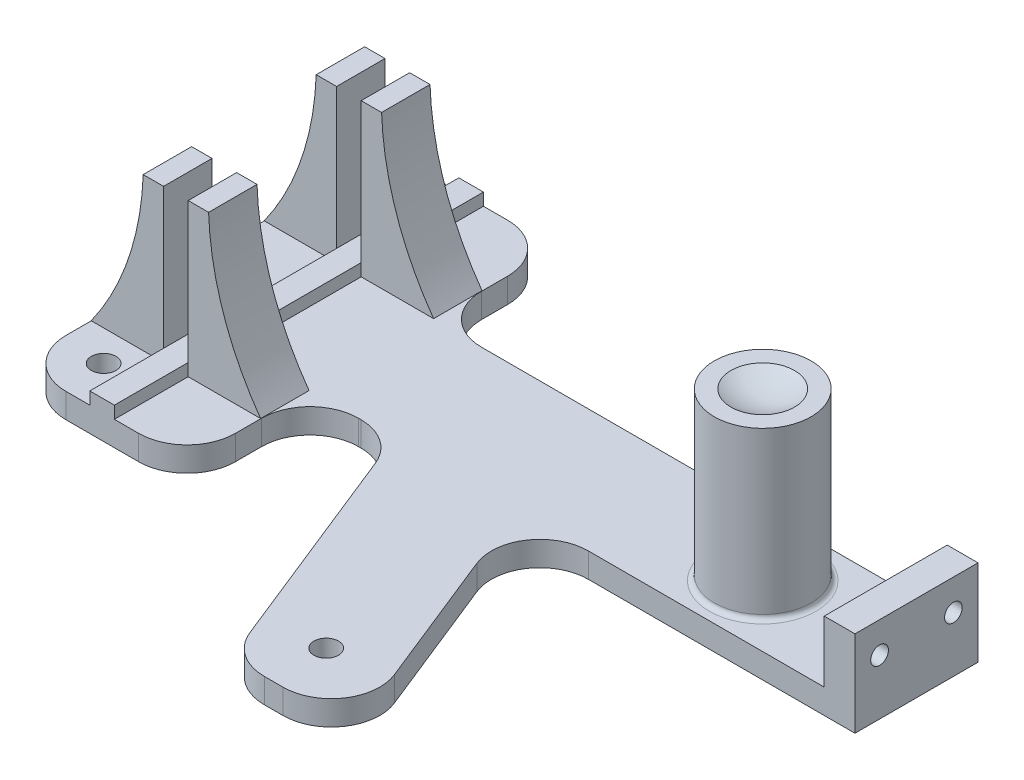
from build123d import *

# Parameters (mm, degrees)
BOSS_EXTRUDE1_DEPTH       = 5.08
BOSS_EXTRUDE2_DEPTH       = 10
SKETCH3_R                 = 10
BOSS_EXTRUDE3_DEPTH       = 34.29
FILLET1_R                 = 1
SKETCH9_W                 = 6.35
SKETCH9_H                 = 25.4
BOSS_EXTRUDE6_DEPTH       = 12.7
F_6_CLEARANCE_HOLE1_D     = 3.6576
F_6_CLEARANCE_HOLE1_DEPTH = 6.35
BOSS_EXTRUDE7_DEPTH       = 5.08
FILLET4_R                 = 10
FILLET5_R                 = 10
CUT_EXTRUDE1_REACH        = 156.38
SKETCH18_R                = 2.54
SKETCH21_W                = 5.08
SKETCH21_H                = 76.2
BOSS_EXTRUDE8_DEPTH       = 2.54


with BuildPart() as part:
    # Sketch1 → Boss-Extrude1 (new body)
    with BuildSketch(Plane(origin=(0, 0, 0), x_dir=(1, 0, 0), z_dir=(0, 1, 0))):
        with BuildLine():
            Line((20.08, 28.1), (20.08, 22.7))
            ThreePointArc((20.08, 22.7), (23.008932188, 15.628932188), (30.08, 12.7))
            Line((30.08, 12.7), (126.24, 12.7))
            Line((126.24, 12.7), (132.59, 12.7))
            Line((132.59, 12.7), (132.59, 0))
            Line((132.59, 0), (132.59, -12.7))
            Line((132.59, -12.7), (126.24, -12.7))
            Line((126.24, -12.7), (30.08, -12.7))
            ThreePointArc((30.08, -12.7), (23.008932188, -15.628932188), (20.08, -22.7))
            Line((20.08, -22.7), (20.08, -28.1))
            ThreePointArc((20.08, -28.1), (17.151067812, -35.171067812), (10.08, -38.1))
            Line((10.08, -38.1), (-4.92, -38.1))
            ThreePointArc((-4.92, -38.1), (-11.991067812, -35.171067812), (-14.92, -28.1))
            Line((-14.92, -28.1), (-14.92, 28.1))
            ThreePointArc((-14.92, 28.1), (-11.991067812, 35.171067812), (-4.92, 38.1))
            Line((-4.92, 38.1), (10.08, 38.1))
            ThreePointArc((10.08, 38.1), (17.151067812, 35.171067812), (20.08, 28.1))
        make_face()
    extrude(amount=-BOSS_EXTRUDE1_DEPTH)

    # Sketch2 → Boss-Extrude2 (add)
    with BuildSketch(Plane.XY.offset(22.86)):
        with BuildLine():
            Line((0, 0), (-14.953299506, 0))
            ThreePointArc((-14.953299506, 0), (-7.255141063, 14.95657571), (-4.209502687, 31.5))
            Line((-4.209502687, 31.5), (0, 31.5))
            Line((0, 31.5), (0, 0))
        make_face()
        with BuildLine():
            Line((5.08, 0), (20.033299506, 0))
            ThreePointArc((20.033299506, 0), (12.335141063, 14.95657571), (9.289502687, 31.5))
            Line((9.289502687, 31.5), (5.08, 31.5))
            Line((5.08, 31.5), (5.08, 0))
        make_face()
    boss_extrude2 = extrude(amount=-BOSS_EXTRUDE2_DEPTH)

    # Mirror1: Boss-Extrude2 across plane
    add(boss_extrude2.mirror(Plane.XY))

    # Sketch3 → Boss-Extrude3 (add)
    with BuildSketch(Plane(origin=(0, 0, 0), x_dir=(1, 0, 0), z_dir=(0, 1, 0))):
        with Locations(Location((100.84, 0, 0), (0, 0, 270))):
            Circle(SKETCH3_R)
    extrude(amount=BOSS_EXTRUDE3_DEPTH)

    # Fillet1
    fillet1_edges = [part.edges().sort_by_distance(p)[0] for p in [
        (100.84, 0, -10),
    ]]
    fillet(fillet1_edges, radius=FILLET1_R)

    # Sketch4 → Cut-Revolve1 (revolve, cut)
    with BuildSketch(Plane.XY):
        with BuildLine():
            Line((100.84, 34.29), (107.399510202, 34.29))
            ThreePointArc((107.399510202, 34.29), (104.216336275, 33.092422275), (100.84, 32.683592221))
            Line((100.84, 32.683592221), (100.84, 34.29))
        make_face()
    revolve(axis=Axis((100.84, 34.29, 0), (0, -1, 0)), mode=Mode.SUBTRACT)

    # Sketch9 → Boss-Extrude6 (add)
    with BuildSketch(Plane(origin=(0, 0, 0), x_dir=(1, 0, 0), z_dir=(0, 1, 0))):
        with Locations((129.415, 0)):
            Rectangle(SKETCH9_W, SKETCH9_H)
    extrude(amount=BOSS_EXTRUDE6_DEPTH)

    # 6 Clearance Hole1
    with Locations(Plane(origin=(132.59, 0, 0), x_dir=(0, 0, -1), z_dir=(1, 0, 0))):
        with Locations((7.62, 6.35), (-7.62, 6.35)):
            Hole(F_6_CLEARANCE_HOLE1_D / 2, depth=F_6_CLEARANCE_HOLE1_DEPTH)

    # Sketch17 → Boss-Extrude7 (add)
    with BuildSketch(Plane(origin=(0, 0, 0), x_dir=(1, 0, 0), z_dir=(0, 1, 0))):
        with BuildLine():
            Line((37.34, -12.7), (57.230452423, -62.301920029))
            ThreePointArc((57.230452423, -62.301920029), (60.909296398, -66.863091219), (66.512010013, -68.58))
            Line((66.512010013, -68.58), (70.36390259, -68.58))
            ThreePointArc((70.36390259, -68.58), (78.646993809, -64.182713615), (79.64546018, -54.858079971))
            Line((79.64546018, -54.858079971), (62.74, -12.7))
            Line((62.74, -12.7), (37.34, -12.7))
        make_face()
    extrude(amount=-BOSS_EXTRUDE7_DEPTH)

    # Fillet4
    fillet4_edges = [part.edges().sort_by_distance(p)[0] for p in [
        (62.74, -2.54, 12.7),
    ]]
    fillet(fillet4_edges, radius=FILLET4_R)

    # Fillet5
    fillet5_edges = [part.edges().sort_by_distance(p)[0] for p in [
        (37.34, -2.54, 12.7),
    ]]
    fillet(fillet5_edges, radius=FILLET5_R)

    # Sketch18 → Cut-Extrude1 (cut, up to next)
    with BuildSketch(Plane.XZ.offset(5.08), mode=Mode.PRIVATE) as cut_extrude1_sk1:
        with Locations(Location((-6.03, 29.21, 0), (0, 0, 270))):
            Circle(SKETCH18_R)
    cut_extrude1_tool1 = extrude(cut_extrude1_sk1.sketch, amount=-CUT_EXTRUDE1_REACH, mode=Mode.PRIVATE) & part.part
    # Sketch18 → Cut-Extrude1 (cut, up to next)
    with BuildSketch(Plane.XZ.offset(5.08), mode=Mode.PRIVATE) as cut_extrude1_sk2:
        with Locations(Location((-6.03, -29.21, 0), (0, 0, 90))):
            Circle(SKETCH18_R)
    cut_extrude1_tool2 = extrude(cut_extrude1_sk2.sketch, amount=-CUT_EXTRUDE1_REACH, mode=Mode.PRIVATE) & part.part
    # Sketch18 → Cut-Extrude1 (cut, up to next)
    with BuildSketch(Plane.XZ.offset(5.08), mode=Mode.PRIVATE) as cut_extrude1_sk3:
        with Locations(Location((67.864523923, 57.15, 0), (0, 0, 270))):
            Circle(SKETCH18_R)
    cut_extrude1_tool3 = extrude(cut_extrude1_sk3.sketch, amount=-CUT_EXTRUDE1_REACH, mode=Mode.PRIVATE) & part.part
    # Sketch18 → Cut-Extrude1 (cut, up to next)
    with BuildSketch(Plane.XZ.offset(5.08), mode=Mode.PRIVATE) as cut_extrude1_sk4:
        with Locations(Location((118.62, 0, 0), (0, 0, 270))):
            Circle(SKETCH18_R)
    cut_extrude1_tool4 = extrude(cut_extrude1_sk4.sketch, amount=-CUT_EXTRUDE1_REACH, mode=Mode.PRIVATE) & part.part
    add(cut_extrude1_tool1.solids().sort_by_distance((-6.03, -5.08, 29.21))[0], mode=Mode.SUBTRACT)
    add(cut_extrude1_tool2.solids().sort_by_distance((-6.03, -5.08, -29.21))[0], mode=Mode.SUBTRACT)
    add(cut_extrude1_tool3.solids().sort_by_distance((67.864524, -5.08, 57.15))[0], mode=Mode.SUBTRACT)
    add(cut_extrude1_tool4.solids().sort_by_distance((118.62, -5.08, 0))[0], mode=Mode.SUBTRACT)

    # Sketch21 → Boss-Extrude8 (add)
    with BuildSketch(Plane(origin=(0, 0, 0), x_dir=(1, 0, 0), z_dir=(0, 1, 0))):
        with Locations((2.54, 0)):
            Rectangle(SKETCH21_W, SKETCH21_H)
    extrude(amount=BOSS_EXTRUDE8_DEPTH)


solid = part.part
